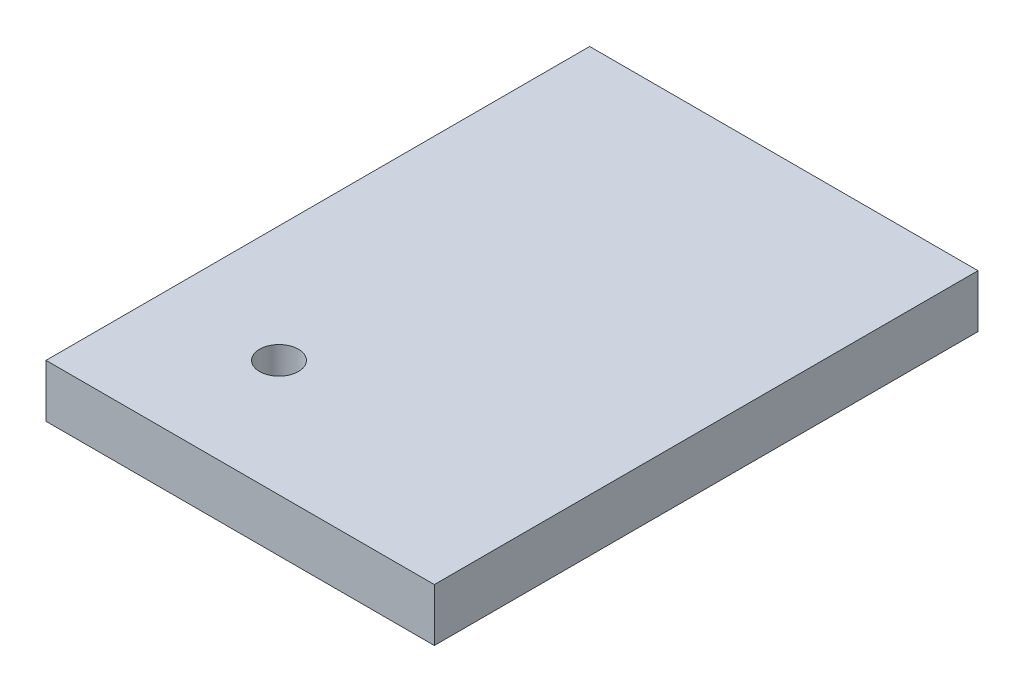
ISO-10303-21;
HEADER;
FILE_DESCRIPTION(('STEP AP214'),'2;1');
FILE_NAME('part.step','',(''),(''),'','','');
FILE_SCHEMA(('AUTOMOTIVE_DESIGN { 1 0 10303 214 1 1 1 1 }'));
ENDSEC;
DATA;
#1=APPLICATION_CONTEXT('core data for automotive mechanical design processes');
#2=APPLICATION_PROTOCOL_DEFINITION('international standard','automotive_design',2000,#1);
#3=PRODUCT_CONTEXT('',#1,'mechanical');
#4=PRODUCT('Part','Part','',(#3));
#5=PRODUCT_RELATED_PRODUCT_CATEGORY('part','',(#4));
#6=PRODUCT_DEFINITION_FORMATION('','',#4);
#7=PRODUCT_DEFINITION_CONTEXT('part definition',#1,'design');
#8=PRODUCT_DEFINITION('design','',#6,#7);
#9=PRODUCT_DEFINITION_SHAPE('','',#8);
#10=(LENGTH_UNIT() NAMED_UNIT(*) SI_UNIT(.MILLI.,.METRE.));
#11=(NAMED_UNIT(*) PLANE_ANGLE_UNIT() SI_UNIT($,.RADIAN.));
#12=(NAMED_UNIT(*) SI_UNIT($,.STERADIAN.) SOLID_ANGLE_UNIT());
#13=UNCERTAINTY_MEASURE_WITH_UNIT(LENGTH_MEASURE(1.E-05),#10,'distance_accuracy_value','');
#14=(GEOMETRIC_REPRESENTATION_CONTEXT(3) GLOBAL_UNCERTAINTY_ASSIGNED_CONTEXT((#13)) GLOBAL_UNIT_ASSIGNED_CONTEXT((#10,
#11,#12)) REPRESENTATION_CONTEXT('',''));
#15=CARTESIAN_POINT('',(0.,0.,0.));
#16=DIRECTION('',(0.,0.,1.));
#17=DIRECTION('',(1.,0.,0.));
#18=AXIS2_PLACEMENT_3D('',#15,#16,#17);
#19=CARTESIAN_POINT('',(-63.5,17.272,-88.9));
#20=DIRECTION('',(1.,0.,0.));
#21=DIRECTION('',(0.,0.,-1.));
#22=AXIS2_PLACEMENT_3D('',#19,#20,#21);
#23=PLANE('',#22);
#24=DIRECTION('',(0.,0.,1.));
#25=VECTOR('',#24,1.);
#26=CARTESIAN_POINT('',(-63.5,0.,-88.9));
#27=LINE('',#26,#25);
#28=CARTESIAN_POINT('',(-63.5,0.,-88.9));
#29=VERTEX_POINT('',#28);
#30=CARTESIAN_POINT('',(-63.5,0.,88.9));
#31=VERTEX_POINT('',#30);
#32=EDGE_CURVE('E94',#29,#31,#27,.T.);
#33=ORIENTED_EDGE('',*,*,#32,.T.);
#34=DIRECTION('',(0.,-1.,0.));
#35=VECTOR('',#34,1.);
#36=CARTESIAN_POINT('',(-63.5,17.272,88.9));
#37=LINE('',#36,#35);
#38=CARTESIAN_POINT('',(-63.5,17.272,88.9));
#39=VERTEX_POINT('',#38);
#40=EDGE_CURVE('E11',#39,#31,#37,.T.);
#41=ORIENTED_EDGE('',*,*,#40,.F.);
#42=DIRECTION('',(0.,0.,1.));
#43=VECTOR('',#42,1.);
#44=CARTESIAN_POINT('',(-63.5,17.272,-88.9));
#45=LINE('',#44,#43);
#46=CARTESIAN_POINT('',(-63.5,17.272,-88.9));
#47=VERTEX_POINT('',#46);
#48=EDGE_CURVE('E82',#47,#39,#45,.T.);
#49=ORIENTED_EDGE('',*,*,#48,.F.);
#50=DIRECTION('',(0.,-1.,0.));
#51=VECTOR('',#50,1.);
#52=CARTESIAN_POINT('',(-63.5,17.272,-88.9));
#53=LINE('',#52,#51);
#54=EDGE_CURVE('E90',#47,#29,#53,.T.);
#55=ORIENTED_EDGE('',*,*,#54,.T.);
#56=EDGE_LOOP('',(#33,#41,#49,#55));
#57=FACE_BOUND('',#56,.T.);
#58=ADVANCED_FACE('F31',(#57),#23,.F.);
#59=CARTESIAN_POINT('',(-63.5,17.272,88.9));
#60=DIRECTION('',(0.,0.,-1.));
#61=DIRECTION('',(-1.,0.,0.));
#62=AXIS2_PLACEMENT_3D('',#59,#60,#61);
#63=PLANE('',#62);
#64=DIRECTION('',(1.,0.,0.));
#65=VECTOR('',#64,1.);
#66=CARTESIAN_POINT('',(-63.5,0.,88.9));
#67=LINE('',#66,#65);
#68=CARTESIAN_POINT('',(63.5,0.,88.9));
#69=VERTEX_POINT('',#68);
#70=EDGE_CURVE('E86',#31,#69,#67,.T.);
#71=ORIENTED_EDGE('',*,*,#70,.T.);
#72=DIRECTION('',(0.,-1.,0.));
#73=VECTOR('',#72,1.);
#74=CARTESIAN_POINT('',(63.5,17.272,88.9));
#75=LINE('',#74,#73);
#76=CARTESIAN_POINT('',(63.5,17.272,88.9));
#77=VERTEX_POINT('',#76);
#78=EDGE_CURVE('E39',#77,#69,#75,.T.);
#79=ORIENTED_EDGE('',*,*,#78,.F.);
#80=DIRECTION('',(1.,0.,0.));
#81=VECTOR('',#80,1.);
#82=CARTESIAN_POINT('',(-63.5,17.272,88.9));
#83=LINE('',#82,#81);
#84=EDGE_CURVE('E77',#39,#77,#83,.T.);
#85=ORIENTED_EDGE('',*,*,#84,.F.);
#86=ORIENTED_EDGE('',*,*,#40,.T.);
#87=EDGE_LOOP('',(#71,#79,#85,#86));
#88=FACE_BOUND('',#87,.T.);
#89=ADVANCED_FACE('F85',(#88),#63,.F.);
#90=CARTESIAN_POINT('',(63.5,17.272,-88.9));
#91=DIRECTION('',(-1.,0.,0.));
#92=DIRECTION('',(0.,0.,1.));
#93=AXIS2_PLACEMENT_3D('',#90,#91,#92);
#94=PLANE('',#93);
#95=DIRECTION('',(0.,0.,-1.));
#96=VECTOR('',#95,1.);
#97=CARTESIAN_POINT('',(63.5,0.,-88.9));
#98=LINE('',#97,#96);
#99=CARTESIAN_POINT('',(63.5,0.,-88.9));
#100=VERTEX_POINT('',#99);
#101=EDGE_CURVE('E64',#69,#100,#98,.T.);
#102=ORIENTED_EDGE('',*,*,#101,.T.);
#103=DIRECTION('',(0.,-1.,0.));
#104=VECTOR('',#103,1.);
#105=CARTESIAN_POINT('',(63.5,17.272,-88.9));
#106=LINE('',#105,#104);
#107=CARTESIAN_POINT('',(63.5,17.272,-88.9));
#108=VERTEX_POINT('',#107);
#109=EDGE_CURVE('E87',#108,#100,#106,.T.);
#110=ORIENTED_EDGE('',*,*,#109,.F.);
#111=DIRECTION('',(0.,0.,-1.));
#112=VECTOR('',#111,1.);
#113=CARTESIAN_POINT('',(63.5,17.272,-88.9));
#114=LINE('',#113,#112);
#115=EDGE_CURVE('E80',#77,#108,#114,.T.);
#116=ORIENTED_EDGE('',*,*,#115,.F.);
#117=ORIENTED_EDGE('',*,*,#78,.T.);
#118=EDGE_LOOP('',(#102,#110,#116,#117));
#119=FACE_BOUND('',#118,.T.);
#120=ADVANCED_FACE('F88',(#119),#94,.F.);
#121=CARTESIAN_POINT('',(-63.5,17.272,-88.9));
#122=DIRECTION('',(0.,0.,1.));
#123=DIRECTION('',(1.,0.,0.));
#124=AXIS2_PLACEMENT_3D('',#121,#122,#123);
#125=PLANE('',#124);
#126=DIRECTION('',(-1.,0.,0.));
#127=VECTOR('',#126,1.);
#128=CARTESIAN_POINT('',(-63.5,0.,-88.9));
#129=LINE('',#128,#127);
#130=EDGE_CURVE('E70',#100,#29,#129,.T.);
#131=ORIENTED_EDGE('',*,*,#130,.T.);
#132=ORIENTED_EDGE('',*,*,#54,.F.);
#133=DIRECTION('',(-1.,0.,0.));
#134=VECTOR('',#133,1.);
#135=CARTESIAN_POINT('',(-63.5,17.272,-88.9));
#136=LINE('',#135,#134);
#137=EDGE_CURVE('E47',#108,#47,#136,.T.);
#138=ORIENTED_EDGE('',*,*,#137,.F.);
#139=ORIENTED_EDGE('',*,*,#109,.T.);
#140=EDGE_LOOP('',(#131,#132,#138,#139));
#141=FACE_BOUND('',#140,.T.);
#142=ADVANCED_FACE('F102',(#141),#125,.F.);
#143=CARTESIAN_POINT('',(-63.5,17.272,88.9));
#144=DIRECTION('',(0.,1.,0.));
#145=DIRECTION('',(0.,0.,1.));
#146=AXIS2_PLACEMENT_3D('',#143,#144,#145);
#147=PLANE('',#146);
#148=CARTESIAN_POINT('',(-25.4,17.272,50.8));
#149=DIRECTION('',(0.,1.,0.));
#150=DIRECTION('',(0.,0.,1.));
#151=AXIS2_PLACEMENT_3D('',#148,#149,#150);
#152=CIRCLE('',#151,6.35);
#153=CARTESIAN_POINT('',(-25.4,17.272,57.15));
#154=VERTEX_POINT('',#153);
#155=EDGE_CURVE('E108',#154,#154,#152,.T.);
#156=ORIENTED_EDGE('',*,*,#155,.F.);
#157=EDGE_LOOP('',(#156));
#158=FACE_BOUND('',#157,.T.);
#159=ORIENTED_EDGE('',*,*,#48,.T.);
#160=ORIENTED_EDGE('',*,*,#84,.T.);
#161=ORIENTED_EDGE('',*,*,#115,.T.);
#162=ORIENTED_EDGE('',*,*,#137,.T.);
#163=EDGE_LOOP('',(#159,#160,#161,#162));
#164=FACE_BOUND('',#163,.T.);
#165=ADVANCED_FACE('F78',(#158,#164),#147,.T.);
#166=CARTESIAN_POINT('',(-63.5,0.,88.9));
#167=DIRECTION('',(0.,1.,0.));
#168=DIRECTION('',(0.,0.,1.));
#169=AXIS2_PLACEMENT_3D('',#166,#167,#168);
#170=PLANE('',#169);
#171=CARTESIAN_POINT('',(-25.4,0.,50.8));
#172=DIRECTION('',(0.,1.,0.));
#173=DIRECTION('',(0.,0.,1.));
#174=AXIS2_PLACEMENT_3D('',#171,#172,#173);
#175=CIRCLE('',#174,6.35);
#176=CARTESIAN_POINT('',(-25.4,0.,57.15));
#177=VERTEX_POINT('',#176);
#178=EDGE_CURVE('E97',#177,#177,#175,.T.);
#179=ORIENTED_EDGE('',*,*,#178,.T.);
#180=EDGE_LOOP('',(#179));
#181=FACE_BOUND('',#180,.T.);
#182=ORIENTED_EDGE('',*,*,#32,.F.);
#183=ORIENTED_EDGE('',*,*,#130,.F.);
#184=ORIENTED_EDGE('',*,*,#101,.F.);
#185=ORIENTED_EDGE('',*,*,#70,.F.);
#186=EDGE_LOOP('',(#182,#183,#184,#185));
#187=FACE_BOUND('',#186,.T.);
#188=ADVANCED_FACE('F105',(#181,#187),#170,.F.);
#189=CARTESIAN_POINT('',(-25.4,0.,50.8));
#190=DIRECTION('',(0.,1.,0.));
#191=DIRECTION('',(0.,0.,1.));
#192=AXIS2_PLACEMENT_3D('',#189,#190,#191);
#193=CYLINDRICAL_SURFACE('',#192,6.35);
#194=ORIENTED_EDGE('',*,*,#178,.F.);
#195=EDGE_LOOP('',(#194));
#196=FACE_BOUND('',#195,.T.);
#197=ORIENTED_EDGE('',*,*,#155,.T.);
#198=EDGE_LOOP('',(#197));
#199=FACE_BOUND('',#198,.T.);
#200=ADVANCED_FACE('F115',(#196,#199),#193,.F.);
#201=CLOSED_SHELL('',(#58,#89,#120,#142,#165,#188,#200));
#202=MANIFOLD_SOLID_BREP('B2',#201);
#203=ADVANCED_BREP_SHAPE_REPRESENTATION('',(#18,#202),#14);
#204=SHAPE_DEFINITION_REPRESENTATION(#9,#203);
ENDSEC;
END-ISO-10303-21;
